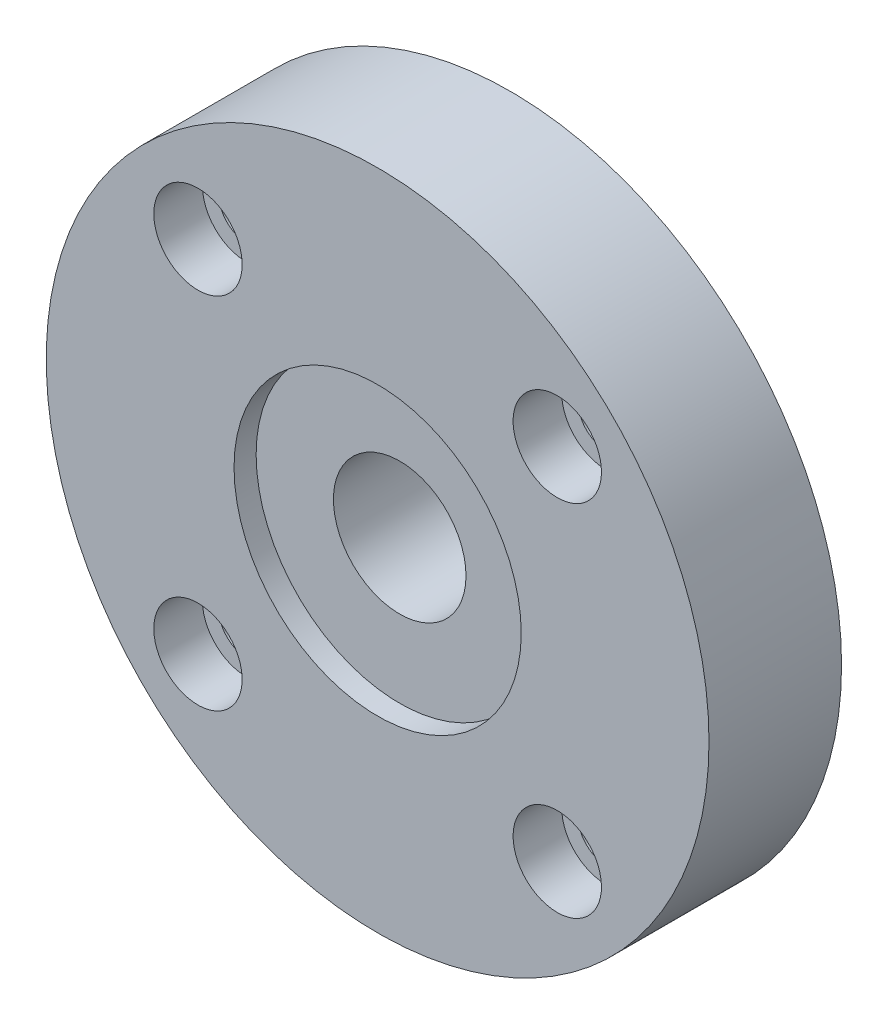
ISO-10303-21;
HEADER;
FILE_DESCRIPTION(('STEP AP214'),'2;1');
FILE_NAME('part.step','',(''),(''),'','','');
FILE_SCHEMA(('AUTOMOTIVE_DESIGN { 1 0 10303 214 1 1 1 1 }'));
ENDSEC;
DATA;
#1=APPLICATION_CONTEXT('core data for automotive mechanical design processes');
#2=APPLICATION_PROTOCOL_DEFINITION('international standard','automotive_design',2000,#1);
#3=PRODUCT_CONTEXT('',#1,'mechanical');
#4=PRODUCT('Part','Part','',(#3));
#5=PRODUCT_RELATED_PRODUCT_CATEGORY('part','',(#4));
#6=PRODUCT_DEFINITION_FORMATION('','',#4);
#7=PRODUCT_DEFINITION_CONTEXT('part definition',#1,'design');
#8=PRODUCT_DEFINITION('design','',#6,#7);
#9=PRODUCT_DEFINITION_SHAPE('','',#8);
#10=(LENGTH_UNIT() NAMED_UNIT(*) SI_UNIT(.MILLI.,.METRE.));
#11=(NAMED_UNIT(*) PLANE_ANGLE_UNIT() SI_UNIT($,.RADIAN.));
#12=(NAMED_UNIT(*) SI_UNIT($,.STERADIAN.) SOLID_ANGLE_UNIT());
#13=UNCERTAINTY_MEASURE_WITH_UNIT(LENGTH_MEASURE(1.E-05),#10,'distance_accuracy_value','');
#14=(GEOMETRIC_REPRESENTATION_CONTEXT(3) GLOBAL_UNCERTAINTY_ASSIGNED_CONTEXT((#13)) GLOBAL_UNIT_ASSIGNED_CONTEXT((#10,
#11,#12)) REPRESENTATION_CONTEXT('',''));
#15=CARTESIAN_POINT('',(0.,0.,0.));
#16=DIRECTION('',(0.,0.,1.));
#17=DIRECTION('',(1.,0.,0.));
#18=AXIS2_PLACEMENT_3D('',#15,#16,#17);
#19=CARTESIAN_POINT('',(0.,0.,12.));
#20=DIRECTION('',(0.,0.,-1.));
#21=DIRECTION('',(-1.,0.,0.));
#22=AXIS2_PLACEMENT_3D('',#19,#20,#21);
#23=CYLINDRICAL_SURFACE('',#22,6.);
#24=CARTESIAN_POINT('',(0.,0.,0.));
#25=DIRECTION('',(0.,0.,1.));
#26=DIRECTION('',(1.,0.,0.));
#27=AXIS2_PLACEMENT_3D('',#24,#25,#26);
#28=CIRCLE('',#27,6.);
#29=CARTESIAN_POINT('',(6.,0.,0.));
#30=VERTEX_POINT('',#29);
#31=EDGE_CURVE('E25',#30,#30,#28,.T.);
#32=ORIENTED_EDGE('',*,*,#31,.F.);
#33=EDGE_LOOP('',(#32));
#34=FACE_BOUND('',#33,.T.);
#35=CARTESIAN_POINT('',(0.,0.,10.));
#36=DIRECTION('',(0.,0.,1.));
#37=DIRECTION('',(1.,0.,0.));
#38=AXIS2_PLACEMENT_3D('',#35,#36,#37);
#39=CIRCLE('',#38,6.);
#40=CARTESIAN_POINT('',(6.,0.,10.));
#41=VERTEX_POINT('',#40);
#42=EDGE_CURVE('E16',#41,#41,#39,.T.);
#43=ORIENTED_EDGE('',*,*,#42,.T.);
#44=EDGE_LOOP('',(#43));
#45=FACE_BOUND('',#44,.T.);
#46=ADVANCED_FACE('F12',(#34,#45),#23,.F.);
#47=CARTESIAN_POINT('',(-16.2634559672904,16.2634559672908,0.));
#48=DIRECTION('',(0.,0.,1.));
#49=DIRECTION('',(1.,0.,0.));
#50=AXIS2_PLACEMENT_3D('',#47,#48,#49);
#51=CYLINDRICAL_SURFACE('',#50,2.5);
#52=CARTESIAN_POINT('',(-16.2634559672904,16.2634559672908,0.));
#53=DIRECTION('',(0.,0.,1.));
#54=DIRECTION('',(0.,1.,0.));
#55=AXIS2_PLACEMENT_3D('',#52,#53,#54);
#56=CIRCLE('',#55,2.5);
#57=CARTESIAN_POINT('',(-16.2634559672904,18.7634559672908,0.));
#58=VERTEX_POINT('',#57);
#59=EDGE_CURVE('E37',#58,#58,#56,.T.);
#60=ORIENTED_EDGE('',*,*,#59,.F.);
#61=EDGE_LOOP('',(#60));
#62=FACE_BOUND('',#61,.T.);
#63=CARTESIAN_POINT('',(-16.2634559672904,16.2634559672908,7.6));
#64=DIRECTION('',(0.,0.,1.));
#65=DIRECTION('',(1.,0.,0.));
#66=AXIS2_PLACEMENT_3D('',#63,#64,#65);
#67=CIRCLE('',#66,2.5);
#68=CARTESIAN_POINT('',(-13.7634559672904,16.2634559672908,7.6));
#69=VERTEX_POINT('',#68);
#70=EDGE_CURVE('E43',#69,#69,#67,.F.);
#71=ORIENTED_EDGE('',*,*,#70,.F.);
#72=EDGE_LOOP('',(#71));
#73=FACE_BOUND('',#72,.T.);
#74=ADVANCED_FACE('F87',(#62,#73),#51,.F.);
#75=CARTESIAN_POINT('',(-16.2634559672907,-16.2634559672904,0.));
#76=DIRECTION('',(0.,0.,1.));
#77=DIRECTION('',(1.,0.,0.));
#78=AXIS2_PLACEMENT_3D('',#75,#76,#77);
#79=CYLINDRICAL_SURFACE('',#78,2.5);
#80=CARTESIAN_POINT('',(-16.2634559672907,-16.2634559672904,0.));
#81=DIRECTION('',(0.,0.,1.));
#82=DIRECTION('',(-1.,0.,0.));
#83=AXIS2_PLACEMENT_3D('',#80,#81,#82);
#84=CIRCLE('',#83,2.5);
#85=CARTESIAN_POINT('',(-18.7634559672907,-16.2634559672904,0.));
#86=VERTEX_POINT('',#85);
#87=EDGE_CURVE('E68',#86,#86,#84,.T.);
#88=ORIENTED_EDGE('',*,*,#87,.F.);
#89=EDGE_LOOP('',(#88));
#90=FACE_BOUND('',#89,.T.);
#91=CARTESIAN_POINT('',(-16.2634559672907,-16.2634559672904,7.6));
#92=DIRECTION('',(0.,0.,1.));
#93=DIRECTION('',(1.,0.,0.));
#94=AXIS2_PLACEMENT_3D('',#91,#92,#93);
#95=CIRCLE('',#94,2.5);
#96=CARTESIAN_POINT('',(-13.7634559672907,-16.2634559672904,7.6));
#97=VERTEX_POINT('',#96);
#98=EDGE_CURVE('E39',#97,#97,#95,.F.);
#99=ORIENTED_EDGE('',*,*,#98,.F.);
#100=EDGE_LOOP('',(#99));
#101=FACE_BOUND('',#100,.T.);
#102=ADVANCED_FACE('F160',(#90,#101),#79,.F.);
#103=CARTESIAN_POINT('',(16.2634559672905,-16.2634559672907,0.));
#104=DIRECTION('',(0.,0.,1.));
#105=DIRECTION('',(1.,0.,0.));
#106=AXIS2_PLACEMENT_3D('',#103,#104,#105);
#107=CYLINDRICAL_SURFACE('',#106,2.5);
#108=CARTESIAN_POINT('',(16.2634559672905,-16.2634559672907,0.));
#109=DIRECTION('',(0.,0.,1.));
#110=DIRECTION('',(0.,-1.,0.));
#111=AXIS2_PLACEMENT_3D('',#108,#109,#110);
#112=CIRCLE('',#111,2.5);
#113=CARTESIAN_POINT('',(16.2634559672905,-18.7634559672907,0.));
#114=VERTEX_POINT('',#113);
#115=EDGE_CURVE('E71',#114,#114,#112,.T.);
#116=ORIENTED_EDGE('',*,*,#115,.F.);
#117=EDGE_LOOP('',(#116));
#118=FACE_BOUND('',#117,.T.);
#119=CARTESIAN_POINT('',(16.2634559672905,-16.2634559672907,7.6));
#120=DIRECTION('',(0.,0.,1.));
#121=DIRECTION('',(1.,0.,0.));
#122=AXIS2_PLACEMENT_3D('',#119,#120,#121);
#123=CIRCLE('',#122,2.5);
#124=CARTESIAN_POINT('',(18.7634559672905,-16.2634559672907,7.6));
#125=VERTEX_POINT('',#124);
#126=EDGE_CURVE('E34',#125,#125,#123,.F.);
#127=ORIENTED_EDGE('',*,*,#126,.F.);
#128=EDGE_LOOP('',(#127));
#129=FACE_BOUND('',#128,.T.);
#130=ADVANCED_FACE('F135',(#118,#129),#107,.F.);
#131=CARTESIAN_POINT('',(16.2634559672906,16.2634559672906,0.));
#132=DIRECTION('',(0.,0.,1.));
#133=DIRECTION('',(1.,0.,0.));
#134=AXIS2_PLACEMENT_3D('',#131,#132,#133);
#135=CYLINDRICAL_SURFACE('',#134,2.5);
#136=CARTESIAN_POINT('',(16.2634559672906,16.2634559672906,0.));
#137=DIRECTION('',(0.,0.,1.));
#138=DIRECTION('',(1.,0.,0.));
#139=AXIS2_PLACEMENT_3D('',#136,#137,#138);
#140=CIRCLE('',#139,2.5);
#141=CARTESIAN_POINT('',(18.7634559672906,16.2634559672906,0.));
#142=VERTEX_POINT('',#141);
#143=EDGE_CURVE('E32',#142,#142,#140,.T.);
#144=ORIENTED_EDGE('',*,*,#143,.F.);
#145=EDGE_LOOP('',(#144));
#146=FACE_BOUND('',#145,.T.);
#147=CARTESIAN_POINT('',(16.2634559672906,16.2634559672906,7.6));
#148=DIRECTION('',(0.,0.,1.));
#149=DIRECTION('',(1.,0.,0.));
#150=AXIS2_PLACEMENT_3D('',#147,#148,#149);
#151=CIRCLE('',#150,2.5);
#152=CARTESIAN_POINT('',(18.7634559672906,16.2634559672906,7.6));
#153=VERTEX_POINT('',#152);
#154=EDGE_CURVE('E29',#153,#153,#151,.F.);
#155=ORIENTED_EDGE('',*,*,#154,.F.);
#156=EDGE_LOOP('',(#155));
#157=FACE_BOUND('',#156,.T.);
#158=ADVANCED_FACE('F106',(#146,#157),#135,.F.);
#159=CARTESIAN_POINT('',(0.,0.,12.));
#160=DIRECTION('',(0.,0.,1.));
#161=DIRECTION('',(1.,0.,0.));
#162=AXIS2_PLACEMENT_3D('',#159,#160,#161);
#163=PLANE('',#162);
#164=CARTESIAN_POINT('',(0.,0.,12.));
#165=DIRECTION('',(0.,0.,1.));
#166=DIRECTION('',(1.,0.,0.));
#167=AXIS2_PLACEMENT_3D('',#164,#165,#166);
#168=CIRCLE('',#167,13.);
#169=CARTESIAN_POINT('',(13.,0.,12.));
#170=VERTEX_POINT('',#169);
#171=EDGE_CURVE('E94',#170,#170,#168,.T.);
#172=ORIENTED_EDGE('',*,*,#171,.F.);
#173=EDGE_LOOP('',(#172));
#174=FACE_BOUND('',#173,.T.);
#175=CARTESIAN_POINT('',(-16.2634559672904,16.2634559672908,12.));
#176=DIRECTION('',(0.,0.,1.));
#177=DIRECTION('',(0.,1.,0.));
#178=AXIS2_PLACEMENT_3D('',#175,#176,#177);
#179=CIRCLE('',#178,4.);
#180=CARTESIAN_POINT('',(-16.2634559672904,20.2634559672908,12.));
#181=VERTEX_POINT('',#180);
#182=EDGE_CURVE('E52',#181,#181,#179,.T.);
#183=ORIENTED_EDGE('',*,*,#182,.F.);
#184=EDGE_LOOP('',(#183));
#185=FACE_BOUND('',#184,.T.);
#186=CARTESIAN_POINT('',(-16.2634559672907,-16.2634559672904,12.));
#187=DIRECTION('',(0.,0.,1.));
#188=DIRECTION('',(-1.,0.,0.));
#189=AXIS2_PLACEMENT_3D('',#186,#187,#188);
#190=CIRCLE('',#189,4.);
#191=CARTESIAN_POINT('',(-20.2634559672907,-16.2634559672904,12.));
#192=VERTEX_POINT('',#191);
#193=EDGE_CURVE('E45',#192,#192,#190,.T.);
#194=ORIENTED_EDGE('',*,*,#193,.F.);
#195=EDGE_LOOP('',(#194));
#196=FACE_BOUND('',#195,.T.);
#197=CARTESIAN_POINT('',(16.2634559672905,-16.2634559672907,12.));
#198=DIRECTION('',(0.,0.,1.));
#199=DIRECTION('',(0.,-1.,0.));
#200=AXIS2_PLACEMENT_3D('',#197,#198,#199);
#201=CIRCLE('',#200,4.);
#202=CARTESIAN_POINT('',(16.2634559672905,-20.2634559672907,12.));
#203=VERTEX_POINT('',#202);
#204=EDGE_CURVE('E41',#203,#203,#201,.T.);
#205=ORIENTED_EDGE('',*,*,#204,.F.);
#206=EDGE_LOOP('',(#205));
#207=FACE_BOUND('',#206,.T.);
#208=CARTESIAN_POINT('',(16.2634559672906,16.2634559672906,12.));
#209=DIRECTION('',(0.,0.,1.));
#210=DIRECTION('',(1.,0.,0.));
#211=AXIS2_PLACEMENT_3D('',#208,#209,#210);
#212=CIRCLE('',#211,4.);
#213=CARTESIAN_POINT('',(20.2634559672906,16.2634559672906,12.));
#214=VERTEX_POINT('',#213);
#215=EDGE_CURVE('E74',#214,#214,#212,.T.);
#216=ORIENTED_EDGE('',*,*,#215,.F.);
#217=EDGE_LOOP('',(#216));
#218=FACE_BOUND('',#217,.T.);
#219=CARTESIAN_POINT('',(0.,0.,12.));
#220=DIRECTION('',(0.,0.,1.));
#221=DIRECTION('',(1.,0.,0.));
#222=AXIS2_PLACEMENT_3D('',#219,#220,#221);
#223=CIRCLE('',#222,30.);
#224=CARTESIAN_POINT('',(30.,0.,12.));
#225=VERTEX_POINT('',#224);
#226=EDGE_CURVE('E8',#225,#225,#223,.T.);
#227=ORIENTED_EDGE('',*,*,#226,.T.);
#228=EDGE_LOOP('',(#227));
#229=FACE_BOUND('',#228,.T.);
#230=ADVANCED_FACE('F103',(#174,#185,#196,#207,#218,#229),#163,.T.);
#231=CARTESIAN_POINT('',(0.,0.,0.));
#232=DIRECTION('',(0.,0.,1.));
#233=DIRECTION('',(1.,0.,0.));
#234=AXIS2_PLACEMENT_3D('',#231,#232,#233);
#235=PLANE('',#234);
#236=ORIENTED_EDGE('',*,*,#59,.T.);
#237=EDGE_LOOP('',(#236));
#238=FACE_BOUND('',#237,.T.);
#239=ORIENTED_EDGE('',*,*,#87,.T.);
#240=EDGE_LOOP('',(#239));
#241=FACE_BOUND('',#240,.T.);
#242=ORIENTED_EDGE('',*,*,#115,.T.);
#243=EDGE_LOOP('',(#242));
#244=FACE_BOUND('',#243,.T.);
#245=ORIENTED_EDGE('',*,*,#143,.T.);
#246=EDGE_LOOP('',(#245));
#247=FACE_BOUND('',#246,.T.);
#248=CARTESIAN_POINT('',(0.,0.,0.));
#249=DIRECTION('',(0.,0.,1.));
#250=DIRECTION('',(1.,0.,0.));
#251=AXIS2_PLACEMENT_3D('',#248,#249,#250);
#252=CIRCLE('',#251,30.);
#253=CARTESIAN_POINT('',(30.,0.,0.));
#254=VERTEX_POINT('',#253);
#255=EDGE_CURVE('E20',#254,#254,#252,.T.);
#256=ORIENTED_EDGE('',*,*,#255,.F.);
#257=EDGE_LOOP('',(#256));
#258=FACE_BOUND('',#257,.T.);
#259=ORIENTED_EDGE('',*,*,#31,.T.);
#260=EDGE_LOOP('',(#259));
#261=FACE_BOUND('',#260,.T.);
#262=ADVANCED_FACE('F83',(#238,#241,#244,#247,#258,#261),#235,.F.);
#263=CARTESIAN_POINT('',(0.,0.,12.));
#264=DIRECTION('',(0.,0.,-1.));
#265=DIRECTION('',(-1.,0.,0.));
#266=AXIS2_PLACEMENT_3D('',#263,#264,#265);
#267=CYLINDRICAL_SURFACE('',#266,30.);
#268=ORIENTED_EDGE('',*,*,#226,.F.);
#269=EDGE_LOOP('',(#268));
#270=FACE_BOUND('',#269,.T.);
#271=ORIENTED_EDGE('',*,*,#255,.T.);
#272=EDGE_LOOP('',(#271));
#273=FACE_BOUND('',#272,.T.);
#274=ADVANCED_FACE('F14',(#270,#273),#267,.T.);
#275=CARTESIAN_POINT('',(16.2634559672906,16.2634559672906,7.6));
#276=DIRECTION('',(0.,0.,1.));
#277=DIRECTION('',(1.,0.,0.));
#278=AXIS2_PLACEMENT_3D('',#275,#276,#277);
#279=PLANE('',#278);
#280=CARTESIAN_POINT('',(16.2634559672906,16.2634559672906,7.6));
#281=DIRECTION('',(0.,0.,1.));
#282=DIRECTION('',(1.,0.,0.));
#283=AXIS2_PLACEMENT_3D('',#280,#281,#282);
#284=CIRCLE('',#283,4.);
#285=CARTESIAN_POINT('',(20.2634559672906,16.2634559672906,7.6));
#286=VERTEX_POINT('',#285);
#287=EDGE_CURVE('E33',#286,#286,#284,.T.);
#288=ORIENTED_EDGE('',*,*,#287,.T.);
#289=EDGE_LOOP('',(#288));
#290=FACE_BOUND('',#289,.T.);
#291=ORIENTED_EDGE('',*,*,#154,.T.);
#292=EDGE_LOOP('',(#291));
#293=FACE_BOUND('',#292,.T.);
#294=ADVANCED_FACE('F118',(#290,#293),#279,.T.);
#295=CARTESIAN_POINT('',(16.2634559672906,16.2634559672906,7.6));
#296=DIRECTION('',(0.,0.,1.));
#297=DIRECTION('',(1.,0.,0.));
#298=AXIS2_PLACEMENT_3D('',#295,#296,#297);
#299=CYLINDRICAL_SURFACE('',#298,4.);
#300=ORIENTED_EDGE('',*,*,#287,.F.);
#301=EDGE_LOOP('',(#300));
#302=FACE_BOUND('',#301,.T.);
#303=ORIENTED_EDGE('',*,*,#215,.T.);
#304=EDGE_LOOP('',(#303));
#305=FACE_BOUND('',#304,.T.);
#306=ADVANCED_FACE('F115',(#302,#305),#299,.F.);
#307=CARTESIAN_POINT('',(16.2634559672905,-16.2634559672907,7.6));
#308=DIRECTION('',(0.,0.,1.));
#309=DIRECTION('',(0.,-1.,0.));
#310=AXIS2_PLACEMENT_3D('',#307,#308,#309);
#311=PLANE('',#310);
#312=CARTESIAN_POINT('',(16.2634559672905,-16.2634559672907,7.6));
#313=DIRECTION('',(0.,0.,1.));
#314=DIRECTION('',(0.,-1.,0.));
#315=AXIS2_PLACEMENT_3D('',#312,#313,#314);
#316=CIRCLE('',#315,4.);
#317=CARTESIAN_POINT('',(16.2634559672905,-20.2634559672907,7.6));
#318=VERTEX_POINT('',#317);
#319=EDGE_CURVE('E38',#318,#318,#316,.T.);
#320=ORIENTED_EDGE('',*,*,#319,.T.);
#321=EDGE_LOOP('',(#320));
#322=FACE_BOUND('',#321,.T.);
#323=ORIENTED_EDGE('',*,*,#126,.T.);
#324=EDGE_LOOP('',(#323));
#325=FACE_BOUND('',#324,.T.);
#326=ADVANCED_FACE('F117',(#322,#325),#311,.T.);
#327=CARTESIAN_POINT('',(16.2634559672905,-16.2634559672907,7.6));
#328=DIRECTION('',(0.,0.,1.));
#329=DIRECTION('',(1.,0.,0.));
#330=AXIS2_PLACEMENT_3D('',#327,#328,#329);
#331=CYLINDRICAL_SURFACE('',#330,4.);
#332=ORIENTED_EDGE('',*,*,#319,.F.);
#333=EDGE_LOOP('',(#332));
#334=FACE_BOUND('',#333,.T.);
#335=ORIENTED_EDGE('',*,*,#204,.T.);
#336=EDGE_LOOP('',(#335));
#337=FACE_BOUND('',#336,.T.);
#338=ADVANCED_FACE('F126',(#334,#337),#331,.F.);
#339=CARTESIAN_POINT('',(-16.2634559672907,-16.2634559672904,7.6));
#340=DIRECTION('',(0.,0.,1.));
#341=DIRECTION('',(-1.,0.,0.));
#342=AXIS2_PLACEMENT_3D('',#339,#340,#341);
#343=PLANE('',#342);
#344=CARTESIAN_POINT('',(-16.2634559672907,-16.2634559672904,7.6));
#345=DIRECTION('',(0.,0.,1.));
#346=DIRECTION('',(-1.,0.,0.));
#347=AXIS2_PLACEMENT_3D('',#344,#345,#346);
#348=CIRCLE('',#347,4.);
#349=CARTESIAN_POINT('',(-20.2634559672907,-16.2634559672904,7.6));
#350=VERTEX_POINT('',#349);
#351=EDGE_CURVE('E42',#350,#350,#348,.T.);
#352=ORIENTED_EDGE('',*,*,#351,.T.);
#353=EDGE_LOOP('',(#352));
#354=FACE_BOUND('',#353,.T.);
#355=ORIENTED_EDGE('',*,*,#98,.T.);
#356=EDGE_LOOP('',(#355));
#357=FACE_BOUND('',#356,.T.);
#358=ADVANCED_FACE('F173',(#354,#357),#343,.T.);
#359=CARTESIAN_POINT('',(-16.2634559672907,-16.2634559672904,7.6));
#360=DIRECTION('',(0.,0.,1.));
#361=DIRECTION('',(1.,0.,0.));
#362=AXIS2_PLACEMENT_3D('',#359,#360,#361);
#363=CYLINDRICAL_SURFACE('',#362,4.);
#364=ORIENTED_EDGE('',*,*,#351,.F.);
#365=EDGE_LOOP('',(#364));
#366=FACE_BOUND('',#365,.T.);
#367=ORIENTED_EDGE('',*,*,#193,.T.);
#368=EDGE_LOOP('',(#367));
#369=FACE_BOUND('',#368,.T.);
#370=ADVANCED_FACE('F176',(#366,#369),#363,.F.);
#371=CARTESIAN_POINT('',(-16.2634559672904,16.2634559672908,7.6));
#372=DIRECTION('',(0.,0.,1.));
#373=DIRECTION('',(0.,1.,0.));
#374=AXIS2_PLACEMENT_3D('',#371,#372,#373);
#375=PLANE('',#374);
#376=CARTESIAN_POINT('',(-16.2634559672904,16.2634559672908,7.6));
#377=DIRECTION('',(0.,0.,1.));
#378=DIRECTION('',(0.,1.,0.));
#379=AXIS2_PLACEMENT_3D('',#376,#377,#378);
#380=CIRCLE('',#379,4.);
#381=CARTESIAN_POINT('',(-16.2634559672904,20.2634559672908,7.6));
#382=VERTEX_POINT('',#381);
#383=EDGE_CURVE('E46',#382,#382,#380,.T.);
#384=ORIENTED_EDGE('',*,*,#383,.T.);
#385=EDGE_LOOP('',(#384));
#386=FACE_BOUND('',#385,.T.);
#387=ORIENTED_EDGE('',*,*,#70,.T.);
#388=EDGE_LOOP('',(#387));
#389=FACE_BOUND('',#388,.T.);
#390=ADVANCED_FACE('F179',(#386,#389),#375,.T.);
#391=CARTESIAN_POINT('',(-16.2634559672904,16.2634559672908,7.6));
#392=DIRECTION('',(0.,0.,1.));
#393=DIRECTION('',(1.,0.,0.));
#394=AXIS2_PLACEMENT_3D('',#391,#392,#393);
#395=CYLINDRICAL_SURFACE('',#394,4.);
#396=ORIENTED_EDGE('',*,*,#383,.F.);
#397=EDGE_LOOP('',(#396));
#398=FACE_BOUND('',#397,.T.);
#399=ORIENTED_EDGE('',*,*,#182,.T.);
#400=EDGE_LOOP('',(#399));
#401=FACE_BOUND('',#400,.T.);
#402=ADVANCED_FACE('F184',(#398,#401),#395,.F.);
#403=CARTESIAN_POINT('',(0.,0.,10.));
#404=DIRECTION('',(0.,0.,1.));
#405=DIRECTION('',(1.,0.,0.));
#406=AXIS2_PLACEMENT_3D('',#403,#404,#405);
#407=CYLINDRICAL_SURFACE('',#406,13.);
#408=CARTESIAN_POINT('',(0.,0.,10.));
#409=DIRECTION('',(0.,0.,1.));
#410=DIRECTION('',(1.,0.,0.));
#411=AXIS2_PLACEMENT_3D('',#408,#409,#410);
#412=CIRCLE('',#411,13.);
#413=CARTESIAN_POINT('',(13.,0.,10.));
#414=VERTEX_POINT('',#413);
#415=EDGE_CURVE('E92',#414,#414,#412,.T.);
#416=ORIENTED_EDGE('',*,*,#415,.F.);
#417=EDGE_LOOP('',(#416));
#418=FACE_BOUND('',#417,.T.);
#419=ORIENTED_EDGE('',*,*,#171,.T.);
#420=EDGE_LOOP('',(#419));
#421=FACE_BOUND('',#420,.T.);
#422=ADVANCED_FACE('F101',(#418,#421),#407,.F.);
#423=CARTESIAN_POINT('',(0.,0.,10.));
#424=DIRECTION('',(0.,0.,1.));
#425=DIRECTION('',(1.,0.,0.));
#426=AXIS2_PLACEMENT_3D('',#423,#424,#425);
#427=PLANE('',#426);
#428=ORIENTED_EDGE('',*,*,#42,.F.);
#429=EDGE_LOOP('',(#428));
#430=FACE_BOUND('',#429,.T.);
#431=ORIENTED_EDGE('',*,*,#415,.T.);
#432=EDGE_LOOP('',(#431));
#433=FACE_BOUND('',#432,.T.);
#434=ADVANCED_FACE('F188',(#430,#433),#427,.T.);
#435=CLOSED_SHELL('',(#46,#74,#102,#130,#158,#230,#262,#274,#294,#306,#326,#338,#358,#370,#390,
#402,#422,#434));
#436=MANIFOLD_SOLID_BREP('B1',#435);
#437=ADVANCED_BREP_SHAPE_REPRESENTATION('',(#18,#436),#14);
#438=SHAPE_DEFINITION_REPRESENTATION(#9,#437);
ENDSEC;
END-ISO-10303-21;
